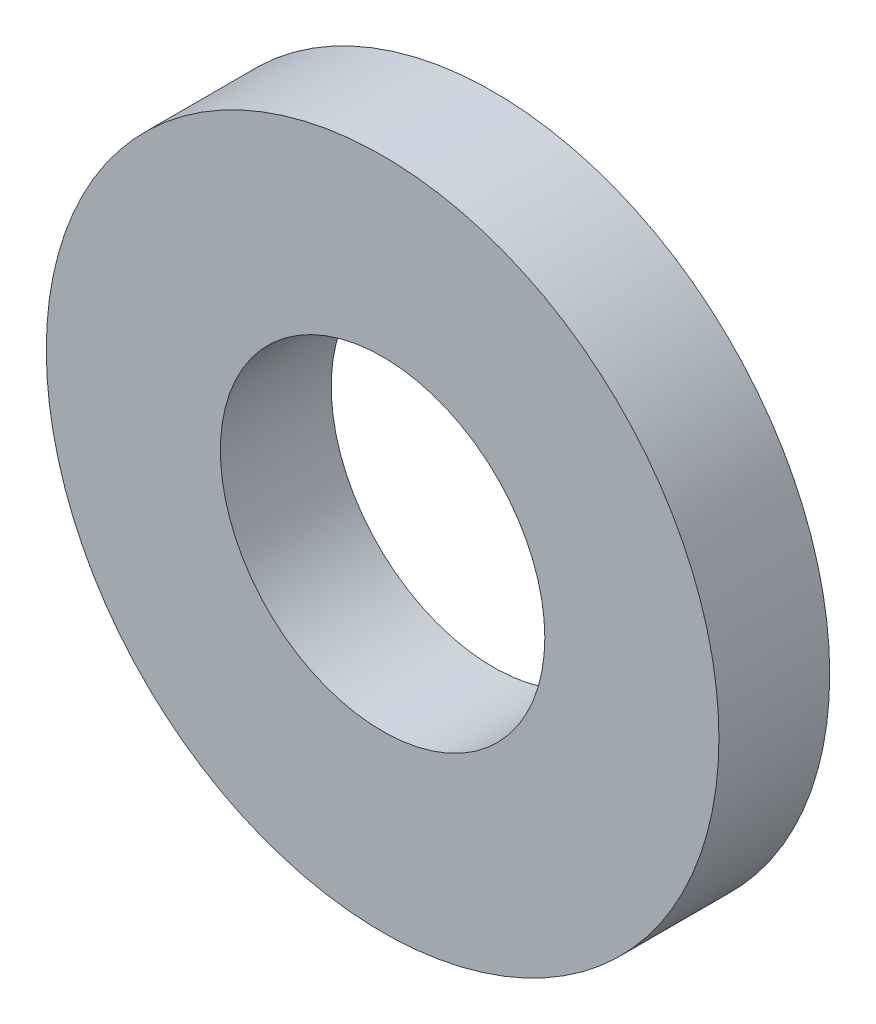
ISO-10303-21;
HEADER;
FILE_DESCRIPTION(('STEP AP214'),'2;1');
FILE_NAME('part.step','',(''),(''),'','','');
FILE_SCHEMA(('AUTOMOTIVE_DESIGN { 1 0 10303 214 1 1 1 1 }'));
ENDSEC;
DATA;
#1=APPLICATION_CONTEXT('core data for automotive mechanical design processes');
#2=APPLICATION_PROTOCOL_DEFINITION('international standard','automotive_design',2000,#1);
#3=PRODUCT_CONTEXT('',#1,'mechanical');
#4=PRODUCT('Part','Part','',(#3));
#5=PRODUCT_RELATED_PRODUCT_CATEGORY('part','',(#4));
#6=PRODUCT_DEFINITION_FORMATION('','',#4);
#7=PRODUCT_DEFINITION_CONTEXT('part definition',#1,'design');
#8=PRODUCT_DEFINITION('design','',#6,#7);
#9=PRODUCT_DEFINITION_SHAPE('','',#8);
#10=(LENGTH_UNIT() NAMED_UNIT(*) SI_UNIT(.MILLI.,.METRE.));
#11=(NAMED_UNIT(*) PLANE_ANGLE_UNIT() SI_UNIT($,.RADIAN.));
#12=(NAMED_UNIT(*) SI_UNIT($,.STERADIAN.) SOLID_ANGLE_UNIT());
#13=UNCERTAINTY_MEASURE_WITH_UNIT(LENGTH_MEASURE(1.E-05),#10,'distance_accuracy_value','');
#14=(GEOMETRIC_REPRESENTATION_CONTEXT(3) GLOBAL_UNCERTAINTY_ASSIGNED_CONTEXT((#13)) GLOBAL_UNIT_ASSIGNED_CONTEXT((#10,
#11,#12)) REPRESENTATION_CONTEXT('',''));
#15=CARTESIAN_POINT('',(0.,0.,0.));
#16=DIRECTION('',(0.,0.,1.));
#17=DIRECTION('',(1.,0.,0.));
#18=AXIS2_PLACEMENT_3D('',#15,#16,#17);
#19=CARTESIAN_POINT('',(0.,0.,2.8));
#20=DIRECTION('',(0.,0.,-1.));
#21=DIRECTION('',(-1.,0.,0.));
#22=AXIS2_PLACEMENT_3D('',#19,#20,#21);
#23=PLANE('',#22);
#24=CARTESIAN_POINT('',(0.,0.,2.8));
#25=DIRECTION('',(0.,0.,1.));
#26=DIRECTION('',(1.,0.,0.));
#27=AXIS2_PLACEMENT_3D('',#24,#25,#26);
#28=CIRCLE('',#27,4.1);
#29=CARTESIAN_POINT('',(4.1,0.,2.8));
#30=VERTEX_POINT('',#29);
#31=EDGE_CURVE('E26',#30,#30,#28,.F.);
#32=ORIENTED_EDGE('',*,*,#31,.T.);
#33=EDGE_LOOP('',(#32));
#34=FACE_BOUND('',#33,.T.);
#35=CARTESIAN_POINT('',(0.,0.,2.8));
#36=DIRECTION('',(0.,0.,1.));
#37=DIRECTION('',(1.,0.,0.));
#38=AXIS2_PLACEMENT_3D('',#35,#36,#37);
#39=CIRCLE('',#38,8.5);
#40=CARTESIAN_POINT('',(8.5,0.,2.8));
#41=VERTEX_POINT('',#40);
#42=EDGE_CURVE('E17',#41,#41,#39,.F.);
#43=ORIENTED_EDGE('',*,*,#42,.F.);
#44=EDGE_LOOP('',(#43));
#45=FACE_BOUND('',#44,.T.);
#46=ADVANCED_FACE('F14',(#34,#45),#23,.F.);
#47=CARTESIAN_POINT('',(0.,0.,0.));
#48=DIRECTION('',(0.,0.,1.));
#49=DIRECTION('',(1.,0.,0.));
#50=AXIS2_PLACEMENT_3D('',#47,#48,#49);
#51=CYLINDRICAL_SURFACE('',#50,8.5);
#52=CARTESIAN_POINT('',(0.,0.,0.));
#53=DIRECTION('',(0.,0.,1.));
#54=DIRECTION('',(1.,0.,0.));
#55=AXIS2_PLACEMENT_3D('',#52,#53,#54);
#56=CIRCLE('',#55,8.5);
#57=CARTESIAN_POINT('',(8.5,0.,0.));
#58=VERTEX_POINT('',#57);
#59=EDGE_CURVE('E21',#58,#58,#56,.F.);
#60=ORIENTED_EDGE('',*,*,#59,.F.);
#61=EDGE_LOOP('',(#60));
#62=FACE_BOUND('',#61,.T.);
#63=ORIENTED_EDGE('',*,*,#42,.T.);
#64=EDGE_LOOP('',(#63));
#65=FACE_BOUND('',#64,.T.);
#66=ADVANCED_FACE('F36',(#62,#65),#51,.T.);
#67=CARTESIAN_POINT('',(0.,0.,0.));
#68=DIRECTION('',(0.,0.,1.));
#69=DIRECTION('',(1.,0.,0.));
#70=AXIS2_PLACEMENT_3D('',#67,#68,#69);
#71=CYLINDRICAL_SURFACE('',#70,4.1);
#72=CARTESIAN_POINT('',(0.,0.,0.));
#73=DIRECTION('',(0.,0.,1.));
#74=DIRECTION('',(1.,0.,0.));
#75=AXIS2_PLACEMENT_3D('',#72,#73,#74);
#76=CIRCLE('',#75,4.1);
#77=CARTESIAN_POINT('',(4.1,0.,0.));
#78=VERTEX_POINT('',#77);
#79=EDGE_CURVE('E10',#78,#78,#76,.T.);
#80=ORIENTED_EDGE('',*,*,#79,.F.);
#81=EDGE_LOOP('',(#80));
#82=FACE_BOUND('',#81,.T.);
#83=ORIENTED_EDGE('',*,*,#31,.F.);
#84=EDGE_LOOP('',(#83));
#85=FACE_BOUND('',#84,.T.);
#86=ADVANCED_FACE('F43',(#82,#85),#71,.F.);
#87=CARTESIAN_POINT('',(0.,0.,0.));
#88=DIRECTION('',(0.,0.,-1.));
#89=DIRECTION('',(-1.,0.,0.));
#90=AXIS2_PLACEMENT_3D('',#87,#88,#89);
#91=PLANE('',#90);
#92=ORIENTED_EDGE('',*,*,#79,.T.);
#93=EDGE_LOOP('',(#92));
#94=FACE_BOUND('',#93,.T.);
#95=ORIENTED_EDGE('',*,*,#59,.T.);
#96=EDGE_LOOP('',(#95));
#97=FACE_BOUND('',#96,.T.);
#98=ADVANCED_FACE('F45',(#94,#97),#91,.T.);
#99=CLOSED_SHELL('',(#46,#66,#86,#98));
#100=MANIFOLD_SOLID_BREP('B1',#99);
#101=ADVANCED_BREP_SHAPE_REPRESENTATION('',(#18,#100),#14);
#102=SHAPE_DEFINITION_REPRESENTATION(#9,#101);
ENDSEC;
END-ISO-10303-21;
